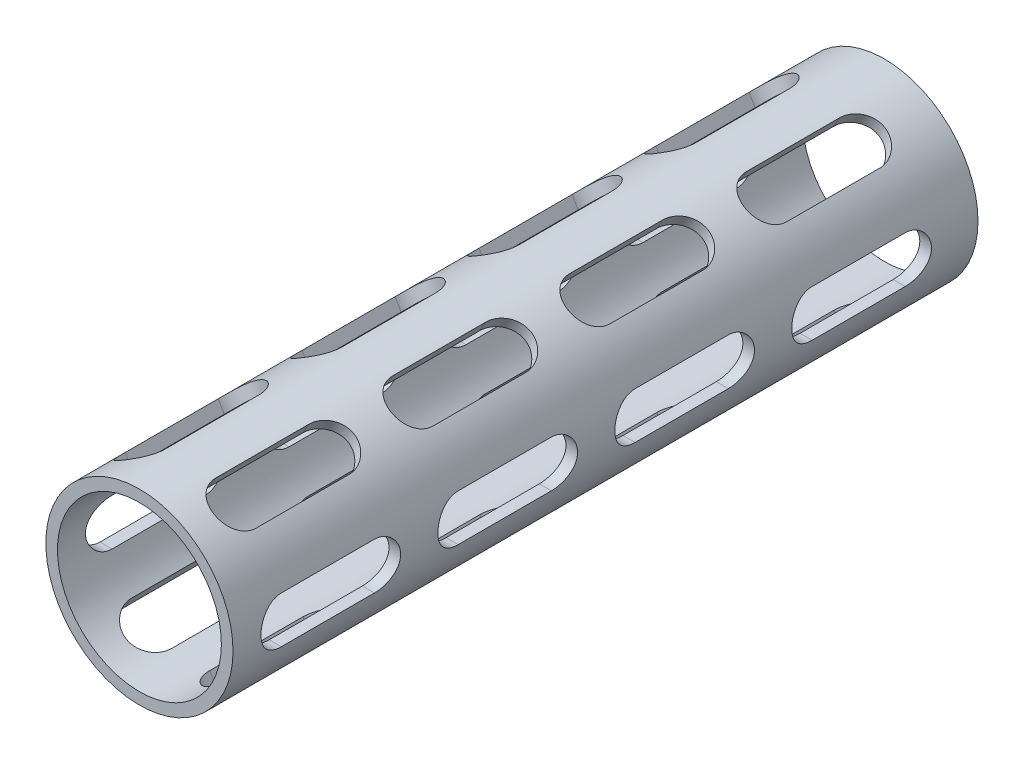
from build123d import *

# Parameters (mm, degrees)
SKETCH1_R               = 25.527
BASE_EXTRUDE_DEPTH      = 203.2
SKETCH2_R               = 22.352
CUT_EXTRUDE1_DEPTH      = 207.381916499
CUT_EXTRUDE2_DEPTH      = 203.2
CUT_EXTRUDE2_DEPTH_BACK = 207.381916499
CUT_EXTRUDE3_DEPTH      = 203.2
CUT_EXTRUDE3_DEPTH_BACK = 207.381916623
CUT_EXTRUDE4_DEPTH      = 203.2
CUT_EXTRUDE4_DEPTH_BACK = 207.381916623


with BuildPart() as part:
    # Sketch1 → Base-Extrude (new body)
    with BuildSketch(Plane.XY):
        Circle(SKETCH1_R)
    extrude(amount=BASE_EXTRUDE_DEPTH)

    # Sketch2 → Cut-Extrude1 (cut, through all)
    with BuildSketch(Plane.XY.offset(203.2)):
        Circle(SKETCH2_R)
    extrude(amount=-CUT_EXTRUDE1_DEPTH, mode=Mode.SUBTRACT)

    # Sketch3 → Cut-Extrude2 (cut, two sides: drawn at the far end of the back side and taken through both)
    with BuildSketch(Plane(origin=(0, 0, 0), x_dir=(0, 0, -1), z_dir=(1, 0, 0)).offset(-CUT_EXTRUDE2_DEPTH_BACK)):
        with BuildLine():
            Line((-44.45, 6.35), (-19.05, 6.35))
            ThreePointArc((-19.05, 6.35), (-12.7, 0), (-19.05, -6.35))
            Line((-19.05, -6.35), (-44.45, -6.35))
            ThreePointArc((-44.45, -6.35), (-50.8, 0), (-44.45, 6.35))
        make_face()
        with BuildLine():
            Line((-92.71, 6.35), (-67.31, 6.35))
            ThreePointArc((-67.31, 6.35), (-60.96, 0), (-67.31, -6.35))
            Line((-67.31, -6.35), (-92.71, -6.35))
            ThreePointArc((-92.71, -6.35), (-99.06, 0), (-92.71, 6.35))
        make_face()
        with BuildLine():
            Line((-140.97, 6.35), (-115.57, 6.35))
            ThreePointArc((-115.57, 6.35), (-109.22, 0), (-115.57, -6.35))
            Line((-115.57, -6.35), (-140.97, -6.35))
            ThreePointArc((-140.97, -6.35), (-147.32, 0), (-140.97, 6.35))
        make_face()
        with BuildLine():
            Line((-189.23, 6.35), (-163.83, 6.35))
            ThreePointArc((-163.83, 6.35), (-157.48, 0), (-163.83, -6.35))
            Line((-163.83, -6.35), (-189.23, -6.35))
            ThreePointArc((-189.23, -6.35), (-195.58, 0), (-189.23, 6.35))
        make_face()
    extrude(amount=CUT_EXTRUDE2_DEPTH + CUT_EXTRUDE2_DEPTH_BACK, mode=Mode.SUBTRACT)

    # Sketch4 → Cut-Extrude3 (cut, two sides: drawn at the far end of the back side and taken through both)
    with BuildSketch(Plane(origin=(0, 0, 0), x_dir=(0.8660254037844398, 0.49999999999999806, 0), z_dir=(0.499999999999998, -0.8660254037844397, 0)).offset(-CUT_EXTRUDE3_DEPTH_BACK)):
        with BuildLine():
            Line((-6.35, 189.23), (-6.35, 163.83))
            ThreePointArc((-6.35, 163.83), (0, 157.48), (6.35, 163.83))
            Line((6.35, 163.83), (6.35, 189.23))
            ThreePointArc((6.35, 189.23), (0, 195.58), (-6.35, 189.23))
        make_face()
        with BuildLine():
            Line((-6.35, 140.97), (-6.35, 115.57))
            ThreePointArc((-6.35, 115.57), (0, 109.22), (6.35, 115.57))
            Line((6.35, 115.57), (6.35, 140.97))
            ThreePointArc((6.35, 140.97), (0, 147.32), (-6.35, 140.97))
        make_face()
        with BuildLine():
            Line((-6.35, 92.71), (-6.35, 67.31))
            ThreePointArc((-6.35, 67.31), (0, 60.96), (6.35, 67.31))
            Line((6.35, 67.31), (6.35, 92.71))
            ThreePointArc((6.35, 92.71), (0, 99.06), (-6.35, 92.71))
        make_face()
        with BuildLine():
            Line((-6.35, 44.45), (-6.35, 19.05))
            ThreePointArc((-6.35, 19.05), (0, 12.7), (6.35, 19.05))
            Line((6.35, 19.05), (6.35, 44.45))
            ThreePointArc((6.35, 44.45), (0, 50.8), (-6.35, 44.45))
        make_face()
    extrude(amount=CUT_EXTRUDE3_DEPTH + CUT_EXTRUDE3_DEPTH_BACK, mode=Mode.SUBTRACT)

    # Sketch5 → Cut-Extrude4 (cut, two sides: drawn at the far end of the back side and taken through both)
    with BuildSketch(Plane(origin=(0, 0, 0), x_dir=(-0.8660254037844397, 0.499999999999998, 0), z_dir=(0.49999999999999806, 0.8660254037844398, 0)).offset(-CUT_EXTRUDE4_DEPTH_BACK)):
        with BuildLine():
            Line((-6.35, 189.23), (-6.35, 163.83))
            ThreePointArc((-6.35, 163.83), (0, 157.48), (6.35, 163.83))
            Line((6.35, 163.83), (6.35, 189.23))
            ThreePointArc((6.35, 189.23), (0, 195.58), (-6.35, 189.23))
        make_face()
        with BuildLine():
            Line((-6.35, 140.97), (-6.35, 115.57))
            ThreePointArc((-6.35, 115.57), (0, 109.22), (6.35, 115.57))
            Line((6.35, 115.57), (6.35, 140.97))
            ThreePointArc((6.35, 140.97), (0, 147.32), (-6.35, 140.97))
        make_face()
        with BuildLine():
            Line((-6.35, 92.71), (-6.35, 67.31))
            ThreePointArc((-6.35, 67.31), (0, 60.96), (6.35, 67.31))
            Line((6.35, 67.31), (6.35, 92.71))
            ThreePointArc((6.35, 92.71), (0, 99.06), (-6.35, 92.71))
        make_face()
        with BuildLine():
            Line((-6.35, 44.45), (-6.35, 19.05))
            ThreePointArc((-6.35, 19.05), (0, 12.7), (6.35, 19.05))
            Line((6.35, 19.05), (6.35, 44.45))
            ThreePointArc((6.35, 44.45), (0, 50.8), (-6.35, 44.45))
        make_face()
    extrude(amount=CUT_EXTRUDE4_DEPTH + CUT_EXTRUDE4_DEPTH_BACK, mode=Mode.SUBTRACT)


solid = part.part
